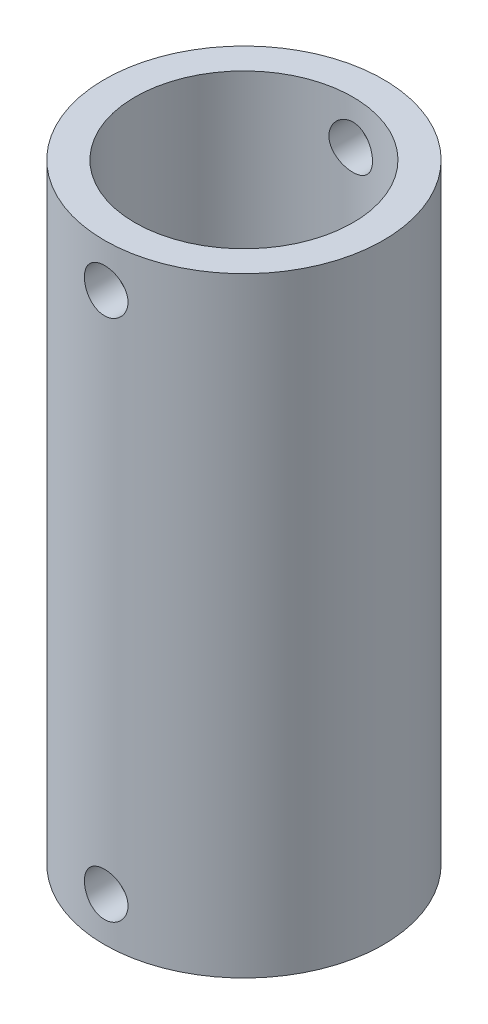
ISO-10303-21;
HEADER;
FILE_DESCRIPTION(('STEP AP214'),'2;1');
FILE_NAME('part.step','',(''),(''),'','','');
FILE_SCHEMA(('AUTOMOTIVE_DESIGN { 1 0 10303 214 1 1 1 1 }'));
ENDSEC;
DATA;
#1=APPLICATION_CONTEXT('core data for automotive mechanical design processes');
#2=APPLICATION_PROTOCOL_DEFINITION('international standard','automotive_design',2000,#1);
#3=PRODUCT_CONTEXT('',#1,'mechanical');
#4=PRODUCT('Part','Part','',(#3));
#5=PRODUCT_RELATED_PRODUCT_CATEGORY('part','',(#4));
#6=PRODUCT_DEFINITION_FORMATION('','',#4);
#7=PRODUCT_DEFINITION_CONTEXT('part definition',#1,'design');
#8=PRODUCT_DEFINITION('design','',#6,#7);
#9=PRODUCT_DEFINITION_SHAPE('','',#8);
#10=(LENGTH_UNIT() NAMED_UNIT(*) SI_UNIT(.MILLI.,.METRE.));
#11=(NAMED_UNIT(*) PLANE_ANGLE_UNIT() SI_UNIT($,.RADIAN.));
#12=(NAMED_UNIT(*) SI_UNIT($,.STERADIAN.) SOLID_ANGLE_UNIT());
#13=UNCERTAINTY_MEASURE_WITH_UNIT(LENGTH_MEASURE(1.E-05),#10,'distance_accuracy_value','');
#14=(GEOMETRIC_REPRESENTATION_CONTEXT(3) GLOBAL_UNCERTAINTY_ASSIGNED_CONTEXT((#13)) GLOBAL_UNIT_ASSIGNED_CONTEXT((#10,
#11,#12)) REPRESENTATION_CONTEXT('',''));
#15=CARTESIAN_POINT('',(0.,0.,0.));
#16=DIRECTION('',(0.,0.,1.));
#17=DIRECTION('',(1.,0.,0.));
#18=AXIS2_PLACEMENT_3D('',#15,#16,#17);
#19=CARTESIAN_POINT('',(0.,69.99,0.));
#20=DIRECTION('',(0.,1.,0.));
#21=DIRECTION('',(0.,0.,1.));
#22=AXIS2_PLACEMENT_3D('',#19,#20,#21);
#23=PLANE('',#22);
#24=CARTESIAN_POINT('',(0.,69.99,0.));
#25=DIRECTION('',(0.,1.,0.));
#26=DIRECTION('',(0.,0.,1.));
#27=AXIS2_PLACEMENT_3D('',#24,#25,#26);
#28=CIRCLE('',#27,16.);
#29=CARTESIAN_POINT('',(0.,69.99,16.));
#30=VERTEX_POINT('',#29);
#31=EDGE_CURVE('E10',#30,#30,#28,.T.);
#32=ORIENTED_EDGE('',*,*,#31,.T.);
#33=EDGE_LOOP('',(#32));
#34=FACE_BOUND('',#33,.T.);
#35=CARTESIAN_POINT('',(0.,69.99,0.));
#36=DIRECTION('',(0.,1.,0.));
#37=DIRECTION('',(0.,0.,1.));
#38=AXIS2_PLACEMENT_3D('',#35,#36,#37);
#39=CIRCLE('',#38,12.5);
#40=CARTESIAN_POINT('',(0.,69.99,12.5));
#41=VERTEX_POINT('',#40);
#42=EDGE_CURVE('E46',#41,#41,#39,.T.);
#43=ORIENTED_EDGE('',*,*,#42,.F.);
#44=EDGE_LOOP('',(#43));
#45=FACE_BOUND('',#44,.T.);
#46=ADVANCED_FACE('F28',(#34,#45),#23,.T.);
#47=CARTESIAN_POINT('',(0.,0.,0.));
#48=DIRECTION('',(0.,1.,0.));
#49=DIRECTION('',(0.,0.,1.));
#50=AXIS2_PLACEMENT_3D('',#47,#48,#49);
#51=PLANE('',#50);
#52=CARTESIAN_POINT('',(0.,0.,0.));
#53=DIRECTION('',(0.,1.,0.));
#54=DIRECTION('',(0.,0.,1.));
#55=AXIS2_PLACEMENT_3D('',#52,#53,#54);
#56=CIRCLE('',#55,16.);
#57=CARTESIAN_POINT('',(0.,0.,16.));
#58=VERTEX_POINT('',#57);
#59=EDGE_CURVE('E41',#58,#58,#56,.T.);
#60=ORIENTED_EDGE('',*,*,#59,.F.);
#61=EDGE_LOOP('',(#60));
#62=FACE_BOUND('',#61,.T.);
#63=CARTESIAN_POINT('',(0.,0.,0.));
#64=DIRECTION('',(0.,1.,0.));
#65=DIRECTION('',(0.,0.,1.));
#66=AXIS2_PLACEMENT_3D('',#63,#64,#65);
#67=CIRCLE('',#66,12.5);
#68=CARTESIAN_POINT('',(0.,0.,12.5));
#69=VERTEX_POINT('',#68);
#70=EDGE_CURVE('E89',#69,#69,#67,.T.);
#71=ORIENTED_EDGE('',*,*,#70,.T.);
#72=EDGE_LOOP('',(#71));
#73=FACE_BOUND('',#72,.T.);
#74=ADVANCED_FACE('F97',(#62,#73),#51,.F.);
#75=CARTESIAN_POINT('',(0.,69.99,0.));
#76=DIRECTION('',(0.,-1.,0.));
#77=DIRECTION('',(0.,0.,-1.));
#78=AXIS2_PLACEMENT_3D('',#75,#76,#77);
#79=CYLINDRICAL_SURFACE('',#78,16.);
#80=CARTESIAN_POINT('',(0.,7.50000000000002,-16.));
#81=CARTESIAN_POINT('',(-0.139515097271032,7.49999430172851,-15.9999977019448));
#82=CARTESIAN_POINT('',(-0.279109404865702,7.48828188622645,-15.9981561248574));
#83=CARTESIAN_POINT('',(-0.5543913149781,7.44175630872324,-15.9909869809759));
#84=CARTESIAN_POINT('',(-0.690075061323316,7.40692110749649,-15.9856560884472));
#85=CARTESIAN_POINT('',(-0.953512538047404,7.31522033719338,-15.9721069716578));
#86=CARTESIAN_POINT('',(-1.0812723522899,7.2583719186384,-15.9638909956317));
#87=CARTESIAN_POINT('',(-1.3254212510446,7.12430145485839,-15.9454779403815));
#88=CARTESIAN_POINT('',(-1.44181181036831,7.04708205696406,-15.9352811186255));
#89=CARTESIAN_POINT('',(-1.66091991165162,6.87376695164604,-15.9139426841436));
#90=CARTESIAN_POINT('',(-1.76352747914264,6.77753300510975,-15.9027945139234));
#91=CARTESIAN_POINT('',(-1.95120768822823,6.56921805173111,-15.8808607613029));
#92=CARTESIAN_POINT('',(-2.03627928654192,6.4571361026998,-15.8700752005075));
#93=CARTESIAN_POINT('',(-2.18690544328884,6.21956172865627,-15.8500242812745));
#94=CARTESIAN_POINT('',(-2.25235273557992,6.09400051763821,-15.840767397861));
#95=CARTESIAN_POINT('',(-2.36118681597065,5.83349858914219,-15.8249120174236));
#96=CARTESIAN_POINT('',(-2.40457491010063,5.69855842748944,-15.8183133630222));
#97=CARTESIAN_POINT('',(-2.46771559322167,5.42428909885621,-15.8085863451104));
#98=CARTESIAN_POINT('',(-2.48765705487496,5.2850044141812,-15.8054302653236));
#99=CARTESIAN_POINT('',(-2.50392369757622,5.00503281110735,-15.8028617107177));
#100=CARTESIAN_POINT('',(-2.50025034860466,4.86434598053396,-15.8034490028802));
#101=CARTESIAN_POINT('',(-2.4695458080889,4.58690296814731,-15.8082755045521));
#102=CARTESIAN_POINT('',(-2.44272562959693,4.45012277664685,-15.8124817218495));
#103=CARTESIAN_POINT('',(-2.36681937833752,4.18302799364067,-15.8240205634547));
#104=CARTESIAN_POINT('',(-2.31773262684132,4.05271359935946,-15.8313532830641));
#105=CARTESIAN_POINT('',(-2.19846916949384,3.80161128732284,-15.8483550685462));
#106=CARTESIAN_POINT('',(-2.12820372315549,3.68086620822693,-15.8580339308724));
#107=CARTESIAN_POINT('',(-1.96864058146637,3.45280046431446,-15.878630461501));
#108=CARTESIAN_POINT('',(-1.87934153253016,3.34548075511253,-15.8895482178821));
#109=CARTESIAN_POINT('',(-1.68309088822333,3.14608975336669,-15.911537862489));
#110=CARTESIAN_POINT('',(-1.57595800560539,3.05419684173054,-15.9226101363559));
#111=CARTESIAN_POINT('',(-1.34769694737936,2.8896668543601,-15.9435512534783));
#112=CARTESIAN_POINT('',(-1.22656870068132,2.81702987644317,-15.9534200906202));
#113=CARTESIAN_POINT('',(-0.973595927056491,2.69306192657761,-15.9708539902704));
#114=CARTESIAN_POINT('',(-0.84174418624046,2.641745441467,-15.9784174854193));
#115=CARTESIAN_POINT('',(-0.571149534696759,2.56203403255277,-15.9903756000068));
#116=CARTESIAN_POINT('',(-0.432407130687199,2.53363742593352,-15.9947704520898));
#117=CARTESIAN_POINT('',(-0.153508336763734,2.50081072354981,-15.9998651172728));
#118=CARTESIAN_POINT('',(-0.0133814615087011,2.49613552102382,-16.0006027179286));
#119=CARTESIAN_POINT('',(0.265654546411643,2.51023270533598,-15.9984028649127));
#120=CARTESIAN_POINT('',(0.404563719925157,2.52900430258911,-15.9954655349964));
#121=CARTESIAN_POINT('',(0.676473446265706,2.58925838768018,-15.9862692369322));
#122=CARTESIAN_POINT('',(0.809501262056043,2.63062075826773,-15.9800278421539));
#123=CARTESIAN_POINT('',(1.06673406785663,2.73475509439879,-15.9649207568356));
#124=CARTESIAN_POINT('',(1.19093861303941,2.79752813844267,-15.9560549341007));
#125=CARTESIAN_POINT('',(1.42807220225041,2.94327199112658,-15.9365897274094));
#126=CARTESIAN_POINT('',(1.54090512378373,3.02639742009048,-15.9259772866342));
#127=CARTESIAN_POINT('',(1.75110696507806,3.21027208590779,-15.9042388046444));
#128=CARTESIAN_POINT('',(1.84847490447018,3.31102243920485,-15.8931127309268));
#129=CARTESIAN_POINT('',(2.02588080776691,3.52838119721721,-15.8714802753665));
#130=CARTESIAN_POINT('',(2.10575398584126,3.64512484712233,-15.860980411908));
#131=CARTESIAN_POINT('',(2.2447556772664,3.89051607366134,-15.8419069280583));
#132=CARTESIAN_POINT('',(2.30388478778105,4.01916330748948,-15.83333325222));
#133=CARTESIAN_POINT('',(2.39946771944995,4.28422964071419,-15.8191307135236));
#134=CARTESIAN_POINT('',(2.43600654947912,4.42061746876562,-15.8134908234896));
#135=CARTESIAN_POINT('',(2.48564122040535,4.69768914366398,-15.8057657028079));
#136=CARTESIAN_POINT('',(2.49873883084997,4.83837266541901,-15.8036802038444));
#137=CARTESIAN_POINT('',(2.50107452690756,5.11839871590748,-15.8033105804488));
#138=CARTESIAN_POINT('',(2.49057180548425,5.2577390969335,-15.804985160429));
#139=CARTESIAN_POINT('',(2.44656223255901,5.53264529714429,-15.8118569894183));
#140=CARTESIAN_POINT('',(2.41305543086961,5.66821112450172,-15.8170542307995));
#141=CARTESIAN_POINT('',(2.32408329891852,5.93163782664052,-15.8303708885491));
#142=CARTESIAN_POINT('',(2.26863761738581,6.05950547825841,-15.8384876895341));
#143=CARTESIAN_POINT('',(2.13738768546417,6.30416561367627,-15.856731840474));
#144=CARTESIAN_POINT('',(2.06158262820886,6.42095765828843,-15.8668592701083));
#145=CARTESIAN_POINT('',(1.8908300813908,6.64146554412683,-15.8881156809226));
#146=CARTESIAN_POINT('',(1.79569107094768,6.74503219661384,-15.8992540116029));
#147=CARTESIAN_POINT('',(1.58937594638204,6.93482123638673,-15.9212004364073));
#148=CARTESIAN_POINT('',(1.47819612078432,7.02103959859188,-15.9320084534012));
#149=CARTESIAN_POINT('',(1.24216685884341,7.17415122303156,-15.952151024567));
#150=CARTESIAN_POINT('',(1.11723937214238,7.24092537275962,-15.9614763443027));
#151=CARTESIAN_POINT('',(0.857851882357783,7.35244099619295,-15.9775125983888));
#152=CARTESIAN_POINT('',(0.723401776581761,7.39720497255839,-15.9842262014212));
#153=CARTESIAN_POINT('',(0.490314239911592,7.45343302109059,-15.9927744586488));
#154=CARTESIAN_POINT('',(0.393105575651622,7.470868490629,-15.9954699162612));
#155=CARTESIAN_POINT('',(0.19727779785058,7.49415391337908,-15.9990834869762));
#156=CARTESIAN_POINT('',(0.0986587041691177,7.50000402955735,-16.0000016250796));
#157=CARTESIAN_POINT('',(0.,7.50000000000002,-16.));
#158=B_SPLINE_CURVE_WITH_KNOTS('',3,(#80,#81,#82,#83,#84,#85,#86,#87,#88,#89,#90,#91,#92,#93,
#94,#95,#96,#97,#98,#99,#100,#101,#102,#103,#104,#105,#106,#107,#108,#109,#110,#111,#112,#113,
#114,#115,#116,#117,#118,#119,#120,#121,#122,#123,#124,#125,#126,#127,#128,#129,#130,#131,#132,
#133,#134,#135,#136,#137,#138,#139,#140,#141,#142,#143,#144,#145,#146,#147,#148,#149,#150,#151,
#152,#153,#154,#155,#156,#157),.UNSPECIFIED.,.T.,.F.,(4,2,2,2,2,2,2,2,2,2,2,2,2,2,2,2,2,2,2,2,2,
2,2,2,2,2,2,2,2,2,2,2,2,2,2,2,2,2,4),(0.,0.41818474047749,0.836768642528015,1.25502707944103,
1.6732311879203,2.09459568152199,2.51598523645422,2.93963778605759,3.36326525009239,
3.78345631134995,4.20362121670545,4.6199957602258,5.03638299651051,5.45453977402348,
5.87272629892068,6.29545732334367,6.71819049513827,7.14121043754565,7.56419931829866,
7.98280854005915,8.40140366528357,8.81779444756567,9.23420620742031,9.65388541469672,
10.0735912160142,10.4970948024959,10.9205861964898,11.3424741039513,11.764330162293,
12.1815758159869,12.598820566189,13.0156924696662,13.4325808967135,13.8538201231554,
14.275156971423,14.6990230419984,15.1224548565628,15.4181801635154,15.7139013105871),.UNSPECIFIED.);
#159=CARTESIAN_POINT('',(0.,7.50000000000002,-16.));
#160=VERTEX_POINT('',#159);
#161=EDGE_CURVE('E57',#160,#160,#158,.T.);
#162=ORIENTED_EDGE('',*,*,#161,.T.);
#163=EDGE_LOOP('',(#162));
#164=FACE_BOUND('',#163,.T.);
#165=CARTESIAN_POINT('',(2.5,5.,15.8034806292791));
#166=CARTESIAN_POINT('',(2.49999429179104,4.86049662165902,15.8034830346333));
#167=CARTESIAN_POINT('',(2.48828377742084,4.72091400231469,15.8053478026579));
#168=CARTESIAN_POINT('',(2.44176643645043,4.44565637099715,15.8125997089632));
#169=CARTESIAN_POINT('',(2.40693752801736,4.30998522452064,15.8179902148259));
#170=CARTESIAN_POINT('',(2.31525516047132,4.04657441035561,15.8316684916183));
#171=CARTESIAN_POINT('',(2.25841914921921,3.91882855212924,15.8399539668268));
#172=CARTESIAN_POINT('',(2.12437791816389,3.67470310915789,15.8584858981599));
#173=CARTESIAN_POINT('',(2.04717531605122,3.55832206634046,15.8687321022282));
#174=CARTESIAN_POINT('',(1.8738773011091,3.33920351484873,15.8901303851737));
#175=CARTESIAN_POINT('',(1.77763988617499,3.23657892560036,15.9012888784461));
#176=CARTESIAN_POINT('',(1.56931080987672,3.04886577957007,15.9231973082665));
#177=CARTESIAN_POINT('',(1.45721825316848,2.96377821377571,15.9339472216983));
#178=CARTESIAN_POINT('',(1.21963429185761,2.81313512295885,15.9538946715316));
#179=CARTESIAN_POINT('',(1.09407592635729,2.74768399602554,15.9630838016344));
#180=CARTESIAN_POINT('',(0.833580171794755,2.63884204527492,15.978803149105));
#181=CARTESIAN_POINT('',(0.698643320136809,2.59544995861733,15.9853335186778));
#182=CARTESIAN_POINT('',(0.42438532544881,2.53230128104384,15.9949542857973));
#183=CARTESIAN_POINT('',(0.28510876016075,2.51235535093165,15.9980722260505));
#184=CARTESIAN_POINT('',(0.00515314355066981,2.49607695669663,16.0006113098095));
#185=CARTESIAN_POINT('',(-0.135525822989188,2.49974307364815,16.0000326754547));
#186=CARTESIAN_POINT('',(-0.413000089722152,2.53043592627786,15.9952657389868));
#187=CARTESIAN_POINT('',(-0.549818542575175,2.55725893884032,15.9911089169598));
#188=CARTESIAN_POINT('',(-0.816988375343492,2.63318402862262,15.9796877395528));
#189=CARTESIAN_POINT('',(-0.947339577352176,2.68228671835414,15.9724232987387));
#190=CARTESIAN_POINT('',(-1.19848742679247,2.80158365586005,15.9555491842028));
#191=CARTESIAN_POINT('',(-1.31924299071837,2.87186300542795,15.9459300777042));
#192=CARTESIAN_POINT('',(-1.54732385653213,3.03145608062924,15.9254174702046));
#193=CARTESIAN_POINT('',(-1.65464819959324,3.12077116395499,15.9145238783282));
#194=CARTESIAN_POINT('',(-1.85402198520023,3.31703348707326,15.8925387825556));
#195=CARTESIAN_POINT('',(-1.94589625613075,3.42415866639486,15.8814464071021));
#196=CARTESIAN_POINT('',(-2.11039226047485,3.65239756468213,15.8604269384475));
#197=CARTESIAN_POINT('',(-2.18301385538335,3.77351138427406,15.8504998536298));
#198=CARTESIAN_POINT('',(-2.30697060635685,4.0264796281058,15.8329349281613));
#199=CARTESIAN_POINT('',(-2.35828663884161,4.15834357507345,15.8252991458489));
#200=CARTESIAN_POINT('',(-2.43799343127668,4.42896484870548,15.8132168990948));
#201=CARTESIAN_POINT('',(-2.46638595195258,4.56772164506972,15.8087701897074));
#202=CARTESIAN_POINT('',(-2.49919719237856,4.84662810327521,15.8036163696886));
#203=CARTESIAN_POINT('',(-2.50386473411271,4.98674780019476,15.80287044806));
#204=CARTESIAN_POINT('',(-2.48975479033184,5.26576763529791,15.8050994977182));
#205=CARTESIAN_POINT('',(-2.47097809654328,5.40466781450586,15.8080743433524));
#206=CARTESIAN_POINT('',(-2.41072412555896,5.67652780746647,15.8173740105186));
#207=CARTESIAN_POINT('',(-2.36937178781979,5.8095159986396,15.8236803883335));
#208=CARTESIAN_POINT('',(-2.26527072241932,6.06667397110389,15.8389172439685));
#209=CARTESIAN_POINT('',(-2.20252085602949,6.19084328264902,15.8478478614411));
#210=CARTESIAN_POINT('',(-2.05681199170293,6.42795128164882,15.8674179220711));
#211=CARTESIAN_POINT('',(-1.97369251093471,6.54079022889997,15.8780706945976));
#212=CARTESIAN_POINT('',(-1.78982593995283,6.75100698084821,15.8998450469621));
#213=CARTESIAN_POINT('',(-1.6890777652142,6.84838383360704,15.9109666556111));
#214=CARTESIAN_POINT('',(-1.47171546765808,7.02581127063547,15.9325473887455));
#215=CARTESIAN_POINT('',(-1.35496564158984,7.10569657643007,15.9429995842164));
#216=CARTESIAN_POINT('',(-1.10955861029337,7.24471951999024,15.9619548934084));
#217=CARTESIAN_POINT('',(-0.980901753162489,7.30385776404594,15.9704580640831));
#218=CARTESIAN_POINT('',(-0.715839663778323,7.39944627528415,15.9845269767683));
#219=CARTESIAN_POINT('',(-0.579467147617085,7.43598549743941,15.9901042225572));
#220=CARTESIAN_POINT('',(-0.302427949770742,7.48562613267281,15.9977412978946));
#221=CARTESIAN_POINT('',(-0.161761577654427,7.49872923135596,15.9998013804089));
#222=CARTESIAN_POINT('',(0.118272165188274,7.50108185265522,16.0001691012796));
#223=CARTESIAN_POINT('',(0.25763742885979,7.49058374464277,15.9985164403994));
#224=CARTESIAN_POINT('',(0.532594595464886,7.44657468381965,15.9917247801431));
#225=CARTESIAN_POINT('',(0.668186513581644,7.41306382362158,15.9865857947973));
#226=CARTESIAN_POINT('',(0.931668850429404,7.32407274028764,15.9733964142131));
#227=CARTESIAN_POINT('',(1.05956579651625,7.26861144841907,15.965348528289));
#228=CARTESIAN_POINT('',(1.30427807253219,7.13732116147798,15.947223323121));
#229=CARTESIAN_POINT('',(1.42109298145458,7.06149139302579,15.9371459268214));
#230=CARTESIAN_POINT('',(1.64160219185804,6.89071055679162,15.9159528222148));
#231=CARTESIAN_POINT('',(1.745151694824,6.79557368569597,15.9048276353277));
#232=CARTESIAN_POINT('',(1.93490712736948,6.5892700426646,15.8828612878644));
#233=CARTESIAN_POINT('',(2.02110898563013,6.4780995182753,15.8720201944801));
#234=CARTESIAN_POINT('',(2.17420151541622,6.24207889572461,15.8517779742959));
#235=CARTESIAN_POINT('',(2.24097044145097,6.11714904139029,15.842386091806));
#236=CARTESIAN_POINT('',(2.35247565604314,5.85775678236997,15.8262143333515));
#237=CARTESIAN_POINT('',(2.3972345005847,5.72330429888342,15.8194317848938));
#238=CARTESIAN_POINT('',(2.45344906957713,5.4902302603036,15.8107909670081));
#239=CARTESIAN_POINT('',(2.47087849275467,5.39303840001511,15.8080643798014));
#240=CARTESIAN_POINT('',(2.49415589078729,5.19724421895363,15.804408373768));
#241=CARTESIAN_POINT('',(2.50000403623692,5.09864191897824,15.8034789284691));
#242=CARTESIAN_POINT('',(2.5,5.,15.8034806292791));
#243=B_SPLINE_CURVE_WITH_KNOTS('',3,(#165,#166,#167,#168,#169,#170,#171,#172,#173,#174,#175,
#176,#177,#178,#179,#180,#181,#182,#183,#184,#185,#186,#187,#188,#189,#190,#191,#192,#193,#194,
#195,#196,#197,#198,#199,#200,#201,#202,#203,#204,#205,#206,#207,#208,#209,#210,#211,#212,#213,
#214,#215,#216,#217,#218,#219,#220,#221,#222,#223,#224,#225,#226,#227,#228,#229,#230,#231,#232,
#233,#234,#235,#236,#237,#238,#239,#240,#241,#242),.UNSPECIFIED.,.T.,.F.,(4,2,2,2,2,2,2,2,2,2,2,
2,2,2,2,2,2,2,2,2,2,2,2,2,2,2,2,2,2,2,2,2,2,2,2,2,2,2,4),(0.,0.41814952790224,0.836699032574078,
1.25491737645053,1.67308199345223,2.09449258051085,2.51592697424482,2.93956378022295,
3.36317633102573,3.78334397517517,4.20348637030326,4.61996979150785,5.03646466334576,
5.45465612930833,5.87287743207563,6.29556043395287,6.71824647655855,7.1413111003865,
7.56434322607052,7.98292940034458,8.40150143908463,8.81778013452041,9.23408098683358,
9.65377352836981,10.0734918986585,10.4970197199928,10.9205351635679,11.3423727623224,
11.7641800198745,12.18149834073,12.5988149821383,13.0157724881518,13.432745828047,
13.8539404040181,14.275233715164,14.6991122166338,15.1225554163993,15.4182305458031,
15.7139013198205),.UNSPECIFIED.);
#244=CARTESIAN_POINT('',(2.5,5.,15.8034806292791));
#245=VERTEX_POINT('',#244);
#246=EDGE_CURVE('E135',#245,#245,#243,.T.);
#247=ORIENTED_EDGE('',*,*,#246,.T.);
#248=EDGE_LOOP('',(#247));
#249=FACE_BOUND('',#248,.T.);
#250=CARTESIAN_POINT('',(0.,67.5,-16.));
#251=CARTESIAN_POINT('',(-0.139515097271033,67.4999943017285,-15.9999977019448));
#252=CARTESIAN_POINT('',(-0.279109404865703,67.4882818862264,-15.9981561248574));
#253=CARTESIAN_POINT('',(-0.554391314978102,67.4417563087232,-15.9909869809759));
#254=CARTESIAN_POINT('',(-0.690075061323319,67.4069211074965,-15.9856560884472));
#255=CARTESIAN_POINT('',(-0.953512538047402,67.3152203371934,-15.9721069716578));
#256=CARTESIAN_POINT('',(-1.0812723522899,67.2583719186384,-15.9638909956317));
#257=CARTESIAN_POINT('',(-1.32542125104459,67.1243014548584,-15.9454779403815));
#258=CARTESIAN_POINT('',(-1.44181181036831,67.0470820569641,-15.9352811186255));
#259=CARTESIAN_POINT('',(-1.66091991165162,66.8737669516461,-15.9139426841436));
#260=CARTESIAN_POINT('',(-1.76352747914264,66.7775330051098,-15.9027945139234));
#261=CARTESIAN_POINT('',(-1.95120768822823,66.5692180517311,-15.8808607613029));
#262=CARTESIAN_POINT('',(-2.03627928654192,66.4571361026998,-15.8700752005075));
#263=CARTESIAN_POINT('',(-2.18690544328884,66.2195617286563,-15.8500242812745));
#264=CARTESIAN_POINT('',(-2.25235273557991,66.0940005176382,-15.840767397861));
#265=CARTESIAN_POINT('',(-2.36118681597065,65.8334985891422,-15.8249120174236));
#266=CARTESIAN_POINT('',(-2.40457491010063,65.6985584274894,-15.8183133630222));
#267=CARTESIAN_POINT('',(-2.46771559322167,65.4242890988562,-15.8085863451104));
#268=CARTESIAN_POINT('',(-2.48765705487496,65.2850044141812,-15.8054302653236));
#269=CARTESIAN_POINT('',(-2.50392369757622,65.0050328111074,-15.8028617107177));
#270=CARTESIAN_POINT('',(-2.50025034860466,64.864345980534,-15.8034490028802));
#271=CARTESIAN_POINT('',(-2.4695458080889,64.5869029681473,-15.8082755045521));
#272=CARTESIAN_POINT('',(-2.44272562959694,64.4501227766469,-15.8124817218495));
#273=CARTESIAN_POINT('',(-2.36681937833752,64.1830279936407,-15.8240205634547));
#274=CARTESIAN_POINT('',(-2.31773262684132,64.0527135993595,-15.8313532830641));
#275=CARTESIAN_POINT('',(-2.19846916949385,63.8016112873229,-15.8483550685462));
#276=CARTESIAN_POINT('',(-2.1282037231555,63.6808662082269,-15.8580339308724));
#277=CARTESIAN_POINT('',(-1.96864058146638,63.4528004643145,-15.878630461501));
#278=CARTESIAN_POINT('',(-1.87934153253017,63.3454807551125,-15.8895482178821));
#279=CARTESIAN_POINT('',(-1.68309088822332,63.1460897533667,-15.911537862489));
#280=CARTESIAN_POINT('',(-1.57595800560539,63.0541968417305,-15.9226101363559));
#281=CARTESIAN_POINT('',(-1.34769694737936,62.8896668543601,-15.9435512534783));
#282=CARTESIAN_POINT('',(-1.22656870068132,62.8170298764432,-15.9534200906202));
#283=CARTESIAN_POINT('',(-0.97359592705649,62.6930619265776,-15.9708539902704));
#284=CARTESIAN_POINT('',(-0.841744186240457,62.641745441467,-15.9784174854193));
#285=CARTESIAN_POINT('',(-0.571149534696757,62.5620340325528,-15.9903756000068));
#286=CARTESIAN_POINT('',(-0.4324071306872,62.5336374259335,-15.9947704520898));
#287=CARTESIAN_POINT('',(-0.153508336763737,62.5008107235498,-15.9998651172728));
#288=CARTESIAN_POINT('',(-0.0133814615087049,62.4961355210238,-16.0006027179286));
#289=CARTESIAN_POINT('',(0.265654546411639,62.510232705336,-15.9984028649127));
#290=CARTESIAN_POINT('',(0.404563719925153,62.5290043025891,-15.9954655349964));
#291=CARTESIAN_POINT('',(0.676473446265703,62.5892583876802,-15.9862692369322));
#292=CARTESIAN_POINT('',(0.809501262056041,62.6306207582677,-15.9800278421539));
#293=CARTESIAN_POINT('',(1.06673406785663,62.7347550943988,-15.9649207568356));
#294=CARTESIAN_POINT('',(1.19093861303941,62.7975281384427,-15.9560549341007));
#295=CARTESIAN_POINT('',(1.42807220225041,62.9432719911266,-15.9365897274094));
#296=CARTESIAN_POINT('',(1.54090512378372,63.0263974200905,-15.9259772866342));
#297=CARTESIAN_POINT('',(1.75110696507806,63.2102720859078,-15.9042388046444));
#298=CARTESIAN_POINT('',(1.84847490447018,63.3110224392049,-15.8931127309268));
#299=CARTESIAN_POINT('',(2.0258808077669,63.5283811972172,-15.8714802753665));
#300=CARTESIAN_POINT('',(2.10575398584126,63.6451248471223,-15.860980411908));
#301=CARTESIAN_POINT('',(2.2447556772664,63.8905160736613,-15.8419069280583));
#302=CARTESIAN_POINT('',(2.30388478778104,64.0191633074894,-15.83333325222));
#303=CARTESIAN_POINT('',(2.39946771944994,64.2842296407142,-15.8191307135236));
#304=CARTESIAN_POINT('',(2.43600654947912,64.4206174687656,-15.8134908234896));
#305=CARTESIAN_POINT('',(2.48564122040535,64.697689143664,-15.8057657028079));
#306=CARTESIAN_POINT('',(2.49873883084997,64.838372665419,-15.8036802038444));
#307=CARTESIAN_POINT('',(2.50107452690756,65.1183987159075,-15.8033105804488));
#308=CARTESIAN_POINT('',(2.49057180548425,65.2577390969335,-15.804985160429));
#309=CARTESIAN_POINT('',(2.44656223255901,65.5326452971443,-15.8118569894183));
#310=CARTESIAN_POINT('',(2.41305543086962,65.6682111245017,-15.8170542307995));
#311=CARTESIAN_POINT('',(2.32408329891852,65.9316378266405,-15.830370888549));
#312=CARTESIAN_POINT('',(2.26863761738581,66.0595054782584,-15.8384876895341));
#313=CARTESIAN_POINT('',(2.13738768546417,66.3041656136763,-15.856731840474));
#314=CARTESIAN_POINT('',(2.06158262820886,66.4209576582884,-15.8668592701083));
#315=CARTESIAN_POINT('',(1.8908300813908,66.6414655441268,-15.8881156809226));
#316=CARTESIAN_POINT('',(1.79569107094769,66.7450321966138,-15.8992540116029));
#317=CARTESIAN_POINT('',(1.58937594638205,66.9348212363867,-15.9212004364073));
#318=CARTESIAN_POINT('',(1.47819612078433,67.0210395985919,-15.9320084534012));
#319=CARTESIAN_POINT('',(1.24216685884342,67.1741512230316,-15.952151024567));
#320=CARTESIAN_POINT('',(1.11723937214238,67.2409253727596,-15.9614763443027));
#321=CARTESIAN_POINT('',(0.857851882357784,67.352440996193,-15.9775125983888));
#322=CARTESIAN_POINT('',(0.723401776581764,67.3972049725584,-15.9842262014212));
#323=CARTESIAN_POINT('',(0.490314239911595,67.4534330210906,-15.9927744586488));
#324=CARTESIAN_POINT('',(0.393105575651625,67.470868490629,-15.9954699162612));
#325=CARTESIAN_POINT('',(0.197277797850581,67.4941539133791,-15.9990834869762));
#326=CARTESIAN_POINT('',(0.0986587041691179,67.5000040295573,-16.0000016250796));
#327=CARTESIAN_POINT('',(0.,67.5,-16.));
#328=B_SPLINE_CURVE_WITH_KNOTS('',3,(#250,#251,#252,#253,#254,#255,#256,#257,#258,#259,#260,
#261,#262,#263,#264,#265,#266,#267,#268,#269,#270,#271,#272,#273,#274,#275,#276,#277,#278,#279,
#280,#281,#282,#283,#284,#285,#286,#287,#288,#289,#290,#291,#292,#293,#294,#295,#296,#297,#298,
#299,#300,#301,#302,#303,#304,#305,#306,#307,#308,#309,#310,#311,#312,#313,#314,#315,#316,#317,
#318,#319,#320,#321,#322,#323,#324,#325,#326,#327),.UNSPECIFIED.,.T.,.F.,(4,2,2,2,2,2,2,2,2,2,2,
2,2,2,2,2,2,2,2,2,2,2,2,2,2,2,2,2,2,2,2,2,2,2,2,2,2,2,4),(0.,0.418184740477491,
0.836768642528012,1.25502707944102,1.6732311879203,2.09459568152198,2.51598523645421,
2.93963778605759,3.36326525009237,3.78345631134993,4.20362121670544,4.61999576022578,
5.0363829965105,5.45453977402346,5.87272629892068,6.29545732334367,6.71819049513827,
7.14121043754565,7.56419931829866,7.98280854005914,8.40140366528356,8.81779444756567,
9.23420620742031,9.65388541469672,10.0735912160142,10.4970948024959,10.9205861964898,
11.3424741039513,11.764330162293,12.1815758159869,12.598820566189,13.0156924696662,
13.4325808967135,13.8538201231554,14.275156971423,14.6990230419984,15.1224548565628,
15.4181801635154,15.7139013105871),.UNSPECIFIED.);
#329=CARTESIAN_POINT('',(0.,67.5,-16.));
#330=VERTEX_POINT('',#329);
#331=EDGE_CURVE('E81',#330,#330,#328,.T.);
#332=ORIENTED_EDGE('',*,*,#331,.T.);
#333=EDGE_LOOP('',(#332));
#334=FACE_BOUND('',#333,.T.);
#335=CARTESIAN_POINT('',(2.5,65.,15.8034806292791));
#336=CARTESIAN_POINT('',(2.49999429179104,64.860496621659,15.8034830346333));
#337=CARTESIAN_POINT('',(2.48828377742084,64.7209140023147,15.8053478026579));
#338=CARTESIAN_POINT('',(2.44176643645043,64.4456563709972,15.8125997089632));
#339=CARTESIAN_POINT('',(2.40693752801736,64.3099852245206,15.8179902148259));
#340=CARTESIAN_POINT('',(2.31525516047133,64.0465744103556,15.8316684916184));
#341=CARTESIAN_POINT('',(2.25841914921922,63.9188285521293,15.8399539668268));
#342=CARTESIAN_POINT('',(2.12437791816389,63.6747031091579,15.8584858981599));
#343=CARTESIAN_POINT('',(2.04717531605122,63.5583220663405,15.8687321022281));
#344=CARTESIAN_POINT('',(1.87387730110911,63.3392035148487,15.8901303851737));
#345=CARTESIAN_POINT('',(1.77763988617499,63.2365789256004,15.9012888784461));
#346=CARTESIAN_POINT('',(1.56931080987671,63.0488657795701,15.9231973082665));
#347=CARTESIAN_POINT('',(1.45721825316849,62.9637782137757,15.9339472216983));
#348=CARTESIAN_POINT('',(1.21963429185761,62.8131351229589,15.9538946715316));
#349=CARTESIAN_POINT('',(1.09407592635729,62.7476839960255,15.9630838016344));
#350=CARTESIAN_POINT('',(0.833580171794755,62.6388420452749,15.978803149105));
#351=CARTESIAN_POINT('',(0.698643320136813,62.5954499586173,15.9853335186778));
#352=CARTESIAN_POINT('',(0.424385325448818,62.5323012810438,15.9949542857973));
#353=CARTESIAN_POINT('',(0.285108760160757,62.5123553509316,15.9980722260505));
#354=CARTESIAN_POINT('',(0.00515314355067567,62.4960769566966,16.0006113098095));
#355=CARTESIAN_POINT('',(-0.135525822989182,62.4997430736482,16.0000326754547));
#356=CARTESIAN_POINT('',(-0.413000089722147,62.5304359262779,15.9952657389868));
#357=CARTESIAN_POINT('',(-0.54981854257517,62.5572589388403,15.9911089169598));
#358=CARTESIAN_POINT('',(-0.816988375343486,62.6331840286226,15.9796877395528));
#359=CARTESIAN_POINT('',(-0.947339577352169,62.6822867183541,15.9724232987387));
#360=CARTESIAN_POINT('',(-1.19848742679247,62.8015836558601,15.9555491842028));
#361=CARTESIAN_POINT('',(-1.31924299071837,62.8718630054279,15.9459300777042));
#362=CARTESIAN_POINT('',(-1.54732385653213,63.0314560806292,15.9254174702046));
#363=CARTESIAN_POINT('',(-1.65464819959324,63.120771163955,15.9145238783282));
#364=CARTESIAN_POINT('',(-1.85402198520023,63.3170334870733,15.8925387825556));
#365=CARTESIAN_POINT('',(-1.94589625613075,63.4241586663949,15.8814464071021));
#366=CARTESIAN_POINT('',(-2.11039226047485,63.6523975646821,15.8604269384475));
#367=CARTESIAN_POINT('',(-2.18301385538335,63.7735113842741,15.8504998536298));
#368=CARTESIAN_POINT('',(-2.30697060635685,64.0264796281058,15.8329349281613));
#369=CARTESIAN_POINT('',(-2.35828663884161,64.1583435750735,15.8252991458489));
#370=CARTESIAN_POINT('',(-2.43799343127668,64.4289648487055,15.8132168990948));
#371=CARTESIAN_POINT('',(-2.46638595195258,64.5677216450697,15.8087701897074));
#372=CARTESIAN_POINT('',(-2.49919719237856,64.8466281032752,15.8036163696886));
#373=CARTESIAN_POINT('',(-2.50386473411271,64.9867478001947,15.80287044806));
#374=CARTESIAN_POINT('',(-2.48975479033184,65.2657676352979,15.8050994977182));
#375=CARTESIAN_POINT('',(-2.47097809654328,65.4046678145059,15.8080743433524));
#376=CARTESIAN_POINT('',(-2.41072412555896,65.6765278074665,15.8173740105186));
#377=CARTESIAN_POINT('',(-2.36937178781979,65.8095159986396,15.8236803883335));
#378=CARTESIAN_POINT('',(-2.26527072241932,66.0666739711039,15.8389172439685));
#379=CARTESIAN_POINT('',(-2.20252085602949,66.190843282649,15.8478478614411));
#380=CARTESIAN_POINT('',(-2.05681199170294,66.4279512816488,15.8674179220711));
#381=CARTESIAN_POINT('',(-1.97369251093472,66.5407902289,15.8780706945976));
#382=CARTESIAN_POINT('',(-1.78982593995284,66.7510069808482,15.8998450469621));
#383=CARTESIAN_POINT('',(-1.68907776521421,66.848383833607,15.9109666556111));
#384=CARTESIAN_POINT('',(-1.47171546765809,67.0258112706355,15.9325473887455));
#385=CARTESIAN_POINT('',(-1.35496564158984,67.1056965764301,15.9429995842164));
#386=CARTESIAN_POINT('',(-1.10955861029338,67.2447195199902,15.9619548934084));
#387=CARTESIAN_POINT('',(-0.980901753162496,67.3038577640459,15.9704580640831));
#388=CARTESIAN_POINT('',(-0.715839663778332,67.3994462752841,15.9845269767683));
#389=CARTESIAN_POINT('',(-0.579467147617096,67.4359854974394,15.9901042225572));
#390=CARTESIAN_POINT('',(-0.302427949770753,67.4856261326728,15.9977412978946));
#391=CARTESIAN_POINT('',(-0.161761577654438,67.498729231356,15.9998013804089));
#392=CARTESIAN_POINT('',(0.118272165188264,67.5010818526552,16.0001691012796));
#393=CARTESIAN_POINT('',(0.257637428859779,67.4905837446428,15.9985164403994));
#394=CARTESIAN_POINT('',(0.532594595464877,67.4465746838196,15.9917247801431));
#395=CARTESIAN_POINT('',(0.668186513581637,67.4130638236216,15.9865857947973));
#396=CARTESIAN_POINT('',(0.931668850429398,67.3240727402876,15.9733964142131));
#397=CARTESIAN_POINT('',(1.05956579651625,67.2686114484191,15.965348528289));
#398=CARTESIAN_POINT('',(1.30427807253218,67.137321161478,15.947223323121));
#399=CARTESIAN_POINT('',(1.42109298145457,67.0614913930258,15.9371459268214));
#400=CARTESIAN_POINT('',(1.64160219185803,66.8907105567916,15.9159528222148));
#401=CARTESIAN_POINT('',(1.74515169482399,66.795573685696,15.9048276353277));
#402=CARTESIAN_POINT('',(1.93490712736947,66.5892700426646,15.8828612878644));
#403=CARTESIAN_POINT('',(2.02110898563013,66.4780995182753,15.8720201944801));
#404=CARTESIAN_POINT('',(2.17420151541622,66.2420788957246,15.8517779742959));
#405=CARTESIAN_POINT('',(2.24097044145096,66.1171490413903,15.842386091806));
#406=CARTESIAN_POINT('',(2.35247565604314,65.85775678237,15.8262143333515));
#407=CARTESIAN_POINT('',(2.39723450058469,65.7233042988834,15.8194317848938));
#408=CARTESIAN_POINT('',(2.45344906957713,65.4902302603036,15.8107909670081));
#409=CARTESIAN_POINT('',(2.47087849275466,65.3930384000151,15.8080643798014));
#410=CARTESIAN_POINT('',(2.49415589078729,65.1972442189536,15.804408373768));
#411=CARTESIAN_POINT('',(2.50000403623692,65.0986419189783,15.8034789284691));
#412=CARTESIAN_POINT('',(2.5,65.,15.8034806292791));
#413=B_SPLINE_CURVE_WITH_KNOTS('',3,(#335,#336,#337,#338,#339,#340,#341,#342,#343,#344,#345,
#346,#347,#348,#349,#350,#351,#352,#353,#354,#355,#356,#357,#358,#359,#360,#361,#362,#363,#364,
#365,#366,#367,#368,#369,#370,#371,#372,#373,#374,#375,#376,#377,#378,#379,#380,#381,#382,#383,
#384,#385,#386,#387,#388,#389,#390,#391,#392,#393,#394,#395,#396,#397,#398,#399,#400,#401,#402,
#403,#404,#405,#406,#407,#408,#409,#410,#411,#412),.UNSPECIFIED.,.T.,.F.,(4,2,2,2,2,2,2,2,2,2,2,
2,2,2,2,2,2,2,2,2,2,2,2,2,2,2,2,2,2,2,2,2,2,2,2,2,2,2,4),(0.,0.418149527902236,
0.836699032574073,1.25491737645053,1.67308199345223,2.09449258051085,2.51592697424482,
2.93956378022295,3.36317633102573,3.78334397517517,4.20348637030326,4.61996979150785,
5.03646466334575,5.45465612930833,5.87287743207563,6.29556043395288,6.71824647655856,
7.14131110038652,7.56434322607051,7.98292940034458,8.40150143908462,8.8177801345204,
9.23408098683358,9.6537735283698,10.0734918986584,10.4970197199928,10.9205351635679,
11.3423727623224,11.7641800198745,12.18149834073,12.5988149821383,13.0157724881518,
13.432745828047,13.8539404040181,14.275233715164,14.6991122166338,15.1225554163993,
15.4182305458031,15.7139013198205),.UNSPECIFIED.);
#414=CARTESIAN_POINT('',(2.5,65.,15.8034806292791));
#415=VERTEX_POINT('',#414);
#416=EDGE_CURVE('E76',#415,#415,#413,.T.);
#417=ORIENTED_EDGE('',*,*,#416,.T.);
#418=EDGE_LOOP('',(#417));
#419=FACE_BOUND('',#418,.T.);
#420=ORIENTED_EDGE('',*,*,#31,.F.);
#421=EDGE_LOOP('',(#420));
#422=FACE_BOUND('',#421,.T.);
#423=ORIENTED_EDGE('',*,*,#59,.T.);
#424=EDGE_LOOP('',(#423));
#425=FACE_BOUND('',#424,.T.);
#426=ADVANCED_FACE('F30',(#164,#249,#334,#419,#422,#425),#79,.T.);
#427=CARTESIAN_POINT('',(0.,69.99,0.));
#428=DIRECTION('',(0.,-1.,0.));
#429=DIRECTION('',(0.,0.,-1.));
#430=AXIS2_PLACEMENT_3D('',#427,#428,#429);
#431=CYLINDRICAL_SURFACE('',#430,12.5);
#432=CARTESIAN_POINT('',(0.,7.50000000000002,-12.5));
#433=CARTESIAN_POINT('',(-0.138942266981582,7.49999488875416,-12.4999974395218));
#434=CARTESIAN_POINT('',(-0.277949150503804,7.48837789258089,-12.4976596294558));
#435=CARTESIAN_POINT('',(-0.552033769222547,7.44225374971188,-12.4885591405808));
#436=CARTESIAN_POINT('',(-0.687108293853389,7.40772841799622,-12.4817929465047));
#437=CARTESIAN_POINT('',(-0.949325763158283,7.31689681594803,-12.4645912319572));
#438=CARTESIAN_POINT('',(-1.07647616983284,7.26061140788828,-12.454159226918));
#439=CARTESIAN_POINT('',(-1.31951997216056,7.12791938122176,-12.4307599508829));
#440=CARTESIAN_POINT('',(-1.43541403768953,7.05151396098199,-12.4177928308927));
#441=CARTESIAN_POINT('',(-1.65423369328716,6.87965376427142,-12.3905541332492));
#442=CARTESIAN_POINT('',(-1.75698487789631,6.78397911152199,-12.3762686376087));
#443=CARTESIAN_POINT('',(-1.94509189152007,6.57676895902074,-12.3481045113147));
#444=CARTESIAN_POINT('',(-2.03044636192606,6.4652322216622,-12.3342259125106));
#445=CARTESIAN_POINT('',(-2.18207938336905,6.22820951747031,-12.3083110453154));
#446=CARTESIAN_POINT('',(-2.24817734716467,6.1026058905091,-12.2962926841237));
#447=CARTESIAN_POINT('',(-2.35826416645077,5.8417954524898,-12.2756567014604));
#448=CARTESIAN_POINT('',(-2.40225520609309,5.70658959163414,-12.267038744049));
#449=CARTESIAN_POINT('',(-2.46631324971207,5.43228909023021,-12.2543201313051));
#450=CARTESIAN_POINT('',(-2.48668624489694,5.29326863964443,-12.2501617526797));
#451=CARTESIAN_POINT('',(-2.5038803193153,5.01372544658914,-12.2466593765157));
#452=CARTESIAN_POINT('',(-2.50070380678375,4.87320285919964,-12.247314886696));
#453=CARTESIAN_POINT('',(-2.47113643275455,4.59688302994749,-12.2533137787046));
#454=CARTESIAN_POINT('',(-2.44509635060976,4.46104648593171,-12.2585863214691));
#455=CARTESIAN_POINT('',(-2.37109471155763,4.19570980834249,-12.273113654));
#456=CARTESIAN_POINT('',(-2.3231321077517,4.06620997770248,-12.2823686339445));
#457=CARTESIAN_POINT('',(-2.2063119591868,3.816211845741,-12.3038904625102));
#458=CARTESIAN_POINT('',(-2.13731537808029,3.69578030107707,-12.3161772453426));
#459=CARTESIAN_POINT('',(-1.9804839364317,3.46807287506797,-12.3423654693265));
#460=CARTESIAN_POINT('',(-1.89264691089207,3.36079850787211,-12.3562670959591));
#461=CARTESIAN_POINT('',(-1.69874983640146,3.16042649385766,-12.3844255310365));
#462=CARTESIAN_POINT('',(-1.59239040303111,3.06761858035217,-12.3986842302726));
#463=CARTESIAN_POINT('',(-1.36546256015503,2.90111538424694,-12.4257212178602));
#464=CARTESIAN_POINT('',(-1.24489396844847,2.82742034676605,-12.4384994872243));
#465=CARTESIAN_POINT('',(-0.992648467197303,2.70118122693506,-12.4611672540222));
#466=CARTESIAN_POINT('',(-0.860954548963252,2.64867026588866,-12.4710522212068));
#467=CARTESIAN_POINT('',(-0.590372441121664,2.56659881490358,-12.4867852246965));
#468=CARTESIAN_POINT('',(-0.451485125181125,2.53703554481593,-12.4926337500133));
#469=CARTESIAN_POINT('',(-0.172948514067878,2.50210886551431,-12.4995667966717));
#470=CARTESIAN_POINT('',(-0.0333508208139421,2.49634895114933,-12.5007293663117));
#471=CARTESIAN_POINT('',(0.244812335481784,2.50812464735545,-12.4983762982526));
#472=CARTESIAN_POINT('',(0.383377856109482,2.52565894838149,-12.4948609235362));
#473=CARTESIAN_POINT('',(0.654264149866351,2.58319593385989,-12.4835958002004));
#474=CARTESIAN_POINT('',(0.786629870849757,2.62299517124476,-12.4758844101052));
#475=CARTESIAN_POINT('',(1.04280906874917,2.72370995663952,-12.4570888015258));
#476=CARTESIAN_POINT('',(1.16662190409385,2.78462708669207,-12.4460043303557));
#477=CARTESIAN_POINT('',(1.40385293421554,2.92670622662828,-12.4214977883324));
#478=CARTESIAN_POINT('',(1.51712531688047,3.00810695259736,-12.4080487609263));
#479=CARTESIAN_POINT('',(1.72854504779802,3.1885229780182,-12.3803683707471));
#480=CARTESIAN_POINT('',(1.82669077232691,3.28754016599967,-12.3661369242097));
#481=CARTESIAN_POINT('',(2.00660147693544,3.50218337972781,-12.3382325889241));
#482=CARTESIAN_POINT('',(2.08809425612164,3.61803936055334,-12.3245715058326));
#483=CARTESIAN_POINT('',(2.23046355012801,3.8620284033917,-12.2996047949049));
#484=CARTESIAN_POINT('',(2.29134088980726,3.99016097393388,-12.2882990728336));
#485=CARTESIAN_POINT('',(2.3903796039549,4.25442061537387,-12.2694185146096));
#486=CARTESIAN_POINT('',(2.42865874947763,4.3905021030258,-12.2618243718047));
#487=CARTESIAN_POINT('',(2.48177162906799,4.66733363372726,-12.2511859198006));
#488=CARTESIAN_POINT('',(2.49660842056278,4.80808306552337,-12.2481410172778));
#489=CARTESIAN_POINT('',(2.50230227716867,5.08752216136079,-12.2469787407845));
#490=CARTESIAN_POINT('',(2.49358947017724,5.22620287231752,-12.2487729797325));
#491=CARTESIAN_POINT('',(2.45338076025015,5.50007912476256,-12.2568893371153));
#492=CARTESIAN_POINT('',(2.42188504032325,5.63527469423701,-12.2632114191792));
#493=CARTESIAN_POINT('',(2.33719642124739,5.89806927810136,-12.279631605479));
#494=CARTESIAN_POINT('',(2.28405626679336,6.02568590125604,-12.2897205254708));
#495=CARTESIAN_POINT('',(2.15763661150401,6.2702593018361,-12.3125428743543));
#496=CARTESIAN_POINT('',(2.08435542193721,6.38721518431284,-12.3252765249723));
#497=CARTESIAN_POINT('',(1.91826478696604,6.60928893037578,-12.3522240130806));
#498=CARTESIAN_POINT('',(1.82514471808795,6.71417191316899,-12.3664593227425));
#499=CARTESIAN_POINT('',(1.62266092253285,6.90696551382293,-12.3946520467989));
#500=CARTESIAN_POINT('',(1.51329346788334,6.99487222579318,-12.4086093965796));
#501=CARTESIAN_POINT('',(1.28004407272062,7.15208660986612,-12.4348458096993));
#502=CARTESIAN_POINT('',(1.15602221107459,7.22119000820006,-12.4471057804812));
#503=CARTESIAN_POINT('',(0.897915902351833,7.33746530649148,-12.468378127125));
#504=CARTESIAN_POINT('',(0.763840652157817,7.38465697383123,-12.4773934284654));
#505=CARTESIAN_POINT('',(0.52455372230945,7.44662987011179,-12.4894093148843));
#506=CARTESIAN_POINT('',(0.420704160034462,7.46660798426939,-12.4933575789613));
#507=CARTESIAN_POINT('',(0.211248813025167,7.49329478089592,-12.4986538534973));
#508=CARTESIAN_POINT('',(0.105643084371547,7.50000388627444,-12.5000019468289));
#509=CARTESIAN_POINT('',(0.,7.50000000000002,-12.5));
#510=B_SPLINE_CURVE_WITH_KNOTS('',3,(#432,#433,#434,#435,#436,#437,#438,#439,#440,#441,#442,
#443,#444,#445,#446,#447,#448,#449,#450,#451,#452,#453,#454,#455,#456,#457,#458,#459,#460,#461,
#462,#463,#464,#465,#466,#467,#468,#469,#470,#471,#472,#473,#474,#475,#476,#477,#478,#479,#480,
#481,#482,#483,#484,#485,#486,#487,#488,#489,#490,#491,#492,#493,#494,#495,#496,#497,#498,#499,
#500,#501,#502,#503,#504,#505,#506,#507,#508,#509),.UNSPECIFIED.,.T.,.F.,(4,2,2,2,2,2,2,2,2,2,2,
2,2,2,2,2,2,2,2,2,2,2,2,2,2,2,2,2,2,2,2,2,2,2,2,2,2,2,4),(0.,0.416440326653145,
0.833211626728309,1.24958433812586,1.66593225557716,2.08733167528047,2.50876399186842,
2.93402987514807,3.35925373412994,3.77890462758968,4.19851260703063,4.61179317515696,
5.02509348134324,5.44118725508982,5.85732886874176,6.28095631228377,6.70458918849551,
7.1288818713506,7.5531231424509,7.97026839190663,8.38739019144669,8.80076134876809,
9.21416348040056,9.63262665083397,10.0511347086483,10.4760157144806,10.9008797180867,
11.3235095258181,11.7460842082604,12.1609930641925,12.5758985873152,12.9897990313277,
13.4037341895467,13.8247019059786,14.2457663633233,14.6712374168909,15.096323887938,
15.4129693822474,15.7296047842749),.UNSPECIFIED.);
#511=CARTESIAN_POINT('',(0.,7.50000000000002,-12.5));
#512=VERTEX_POINT('',#511);
#513=EDGE_CURVE('E33',#512,#512,#510,.T.);
#514=ORIENTED_EDGE('',*,*,#513,.F.);
#515=EDGE_LOOP('',(#514));
#516=FACE_BOUND('',#515,.T.);
#517=CARTESIAN_POINT('',(2.5,5.,12.2474487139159));
#518=CARTESIAN_POINT('',(2.49999486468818,4.86108906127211,12.2474514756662));
#519=CARTESIAN_POINT('',(2.48838292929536,4.72211344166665,12.2498377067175));
#520=CARTESIAN_POINT('',(2.4422807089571,4.44809373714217,12.2591107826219));
#521=CARTESIAN_POINT('',(2.40777211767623,4.31305288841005,12.2660012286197));
#522=CARTESIAN_POINT('',(2.31698945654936,4.05090674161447,12.2834718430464));
#523=CARTESIAN_POINT('',(2.26073703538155,3.92379369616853,12.2940483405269));
#524=CARTESIAN_POINT('',(2.12812276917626,3.68081288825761,12.3176949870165));
#525=CARTESIAN_POINT('',(2.05176204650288,3.56494449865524,12.3307649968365));
#526=CARTESIAN_POINT('',(1.87994768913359,3.34609749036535,12.3581324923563));
#527=CARTESIAN_POINT('',(1.7842641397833,3.24330103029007,12.3724434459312));
#528=CARTESIAN_POINT('',(1.57701697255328,3.05510616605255,12.400561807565));
#529=CARTESIAN_POINT('',(1.46545224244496,2.96970898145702,12.4143691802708));
#530=CARTESIAN_POINT('',(1.22840338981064,2.81802995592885,12.440069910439));
#531=CARTESIAN_POINT('',(1.10280641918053,2.7519212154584,12.4519455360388));
#532=CARTESIAN_POINT('',(0.84201037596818,2.64181265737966,12.4722934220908));
#533=CARTESIAN_POINT('',(0.706812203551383,2.59781077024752,12.480766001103));
#534=CARTESIAN_POINT('',(0.432541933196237,2.53373201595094,12.4932580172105));
#535=CARTESIAN_POINT('',(0.293544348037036,2.51334755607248,12.4973346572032));
#536=CARTESIAN_POINT('',(0.0140464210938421,2.49612262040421,12.5007730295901));
#537=CARTESIAN_POINT('',(-0.126453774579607,2.49927987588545,12.500135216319));
#538=CARTESIAN_POINT('',(-0.40285500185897,2.52881545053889,12.4942608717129));
#539=CARTESIAN_POINT('',(-0.538793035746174,2.55486244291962,12.489089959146));
#540=CARTESIAN_POINT('',(-0.804329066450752,2.62891258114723,12.4748044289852));
#541=CARTESIAN_POINT('',(-0.933926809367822,2.67691660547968,12.465689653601));
#542=CARTESIAN_POINT('',(-1.18404865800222,2.79382510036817,12.444432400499));
#543=CARTESIAN_POINT('',(-1.30451043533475,2.86285937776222,12.4322712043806));
#544=CARTESIAN_POINT('',(-1.53226261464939,3.0197726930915,12.4062617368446));
#545=CARTESIAN_POINT('',(-1.6395514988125,3.10765389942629,12.3924132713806));
#546=CARTESIAN_POINT('',(-1.83987857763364,3.30158405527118,12.3642741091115));
#547=CARTESIAN_POINT('',(-1.93263579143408,3.40792296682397,12.3499799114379));
#548=CARTESIAN_POINT('',(-2.09904623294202,3.63479110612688,12.322789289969));
#549=CARTESIAN_POINT('',(-2.17269909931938,3.75532060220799,12.3098928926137));
#550=CARTESIAN_POINT('',(-2.2989070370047,4.00755207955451,12.2869511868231));
#551=CARTESIAN_POINT('',(-2.35141661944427,4.13927741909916,12.2769120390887));
#552=CARTESIAN_POINT('',(-2.43347585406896,4.40992830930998,12.2609119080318));
#553=CARTESIAN_POINT('',(-2.46302849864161,4.54885291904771,12.2549503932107));
#554=CARTESIAN_POINT('',(-2.49791501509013,4.82741214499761,12.2478869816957));
#555=CARTESIAN_POINT('',(-2.50365464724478,4.96699393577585,12.2467036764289));
#556=CARTESIAN_POINT('',(-2.49184407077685,5.24512055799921,12.2491121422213));
#557=CARTESIAN_POINT('',(-2.47429518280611,5.38366544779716,12.2527036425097));
#558=CARTESIAN_POINT('',(-2.41675552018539,5.65442160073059,12.2641808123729));
#559=CARTESIAN_POINT('',(-2.37698155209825,5.78668085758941,12.2720249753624));
#560=CARTESIAN_POINT('',(-2.27635258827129,6.04265819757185,12.2910872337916));
#561=CARTESIAN_POINT('',(-2.21549585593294,6.1663755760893,12.3023056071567));
#562=CARTESIAN_POINT('',(-2.073510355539,6.4035327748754,12.327035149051));
#563=CARTESIAN_POINT('',(-1.99212769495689,6.51681761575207,12.3405742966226));
#564=CARTESIAN_POINT('',(-1.81173893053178,6.72827078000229,12.3683430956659));
#565=CARTESIAN_POINT('',(-1.71273101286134,6.82643754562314,12.3825728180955));
#566=CARTESIAN_POINT('',(-1.49808068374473,7.00640639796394,12.4103836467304));
#567=CARTESIAN_POINT('',(-1.38220624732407,7.08793413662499,12.4239514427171));
#568=CARTESIAN_POINT('',(-1.13816974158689,7.23036470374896,12.4486781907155));
#569=CARTESIAN_POINT('',(-1.01000818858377,7.29126839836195,12.4598372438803));
#570=CARTESIAN_POINT('',(-0.745756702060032,7.39032217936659,12.4784323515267));
#571=CARTESIAN_POINT('',(-0.609716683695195,7.42860129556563,12.4858894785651));
#572=CARTESIAN_POINT('',(-0.332973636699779,7.48172811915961,12.4963308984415));
#573=CARTESIAN_POINT('',(-0.192271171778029,7.4965786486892,12.4993157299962));
#574=CARTESIAN_POINT('',(0.0871822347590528,7.50231745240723,12.5004635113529));
#575=CARTESIAN_POINT('',(0.225924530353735,7.49361820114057,12.4987094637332));
#576=CARTESIAN_POINT('',(0.499927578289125,7.45341512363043,12.4907510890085));
#577=CARTESIAN_POINT('',(0.635188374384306,7.42191158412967,12.4845468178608));
#578=CARTESIAN_POINT('',(0.898131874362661,7.33717751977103,12.468387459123));
#579=CARTESIAN_POINT('',(1.02583110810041,7.28399655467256,12.4584409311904));
#580=CARTESIAN_POINT('',(1.27055305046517,7.15746939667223,12.435868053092));
#581=CARTESIAN_POINT('',(1.38757491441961,7.08412161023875,12.4232414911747));
#582=CARTESIAN_POINT('',(1.60965972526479,6.91795153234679,12.3964399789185));
#583=CARTESIAN_POINT('',(1.71449929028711,6.82483415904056,12.3822433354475));
#584=CARTESIAN_POINT('',(1.90720654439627,6.62237439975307,12.3540305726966));
#585=CARTESIAN_POINT('',(1.99507020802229,6.51302817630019,12.340014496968));
#586=CARTESIAN_POINT('',(2.15223054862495,6.27980170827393,12.3135835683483));
#587=CARTESIAN_POINT('',(2.22131703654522,6.15577759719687,12.3011875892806));
#588=CARTESIAN_POINT('',(2.33756012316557,5.89766806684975,12.2796309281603));
#589=CARTESIAN_POINT('',(2.38473661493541,5.76359190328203,12.2704673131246));
#590=CARTESIAN_POINT('',(2.44667284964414,5.52434386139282,12.2582420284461));
#591=CARTESIAN_POINT('',(2.46663474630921,5.42053645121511,12.2542196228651));
#592=CARTESIAN_POINT('',(2.49330004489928,5.21116511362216,12.2488219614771));
#593=CARTESIAN_POINT('',(2.50000390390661,5.10560124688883,12.2474466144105));
#594=CARTESIAN_POINT('',(2.5,5.,12.2474487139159));
#595=B_SPLINE_CURVE_WITH_KNOTS('',3,(#517,#518,#519,#520,#521,#522,#523,#524,#525,#526,#527,
#528,#529,#530,#531,#532,#533,#534,#535,#536,#537,#538,#539,#540,#541,#542,#543,#544,#545,#546,
#547,#548,#549,#550,#551,#552,#553,#554,#555,#556,#557,#558,#559,#560,#561,#562,#563,#564,#565,
#566,#567,#568,#569,#570,#571,#572,#573,#574,#575,#576,#577,#578,#579,#580,#581,#582,#583,#584,
#585,#586,#587,#588,#589,#590,#591,#592,#593,#594),.UNSPECIFIED.,.T.,.F.,(4,2,2,2,2,2,2,2,2,2,2,
2,2,2,2,2,2,2,2,2,2,2,2,2,2,2,2,2,2,2,2,2,2,2,2,2,2,2,4),(0.,0.416346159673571,
0.833025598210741,1.24929124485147,1.66553366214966,2.08705631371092,2.50860850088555,
2.93383501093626,3.35902170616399,3.77860622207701,4.19815030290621,4.61171974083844,
5.02530572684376,5.44149810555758,5.85773839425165,6.28123366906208,6.70473695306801,
7.12914657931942,7.55350087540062,7.97059394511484,8.38766336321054,8.80073354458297,
9.21383775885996,9.63232649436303,10.0508583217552,10.4758150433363,10.9007539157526,
11.3232453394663,11.7456858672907,12.1607754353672,12.5758597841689,12.9900004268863,
13.4041738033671,13.8250288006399,14.2459834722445,14.6714724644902,15.096574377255,
15.413095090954,15.729604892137),.UNSPECIFIED.);
#596=CARTESIAN_POINT('',(2.5,5.,12.2474487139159));
#597=VERTEX_POINT('',#596);
#598=EDGE_CURVE('E121',#597,#597,#595,.T.);
#599=ORIENTED_EDGE('',*,*,#598,.F.);
#600=EDGE_LOOP('',(#599));
#601=FACE_BOUND('',#600,.T.);
#602=CARTESIAN_POINT('',(0.,67.5,-12.5));
#603=CARTESIAN_POINT('',(-0.138942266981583,67.4999948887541,-12.4999974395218));
#604=CARTESIAN_POINT('',(-0.277949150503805,67.4883778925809,-12.4976596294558));
#605=CARTESIAN_POINT('',(-0.552033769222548,67.4422537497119,-12.4885591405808));
#606=CARTESIAN_POINT('',(-0.68710829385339,67.4077284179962,-12.4817929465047));
#607=CARTESIAN_POINT('',(-0.949325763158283,67.316896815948,-12.4645912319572));
#608=CARTESIAN_POINT('',(-1.07647616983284,67.2606114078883,-12.454159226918));
#609=CARTESIAN_POINT('',(-1.31951997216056,67.1279193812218,-12.4307599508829));
#610=CARTESIAN_POINT('',(-1.43541403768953,67.051513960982,-12.4177928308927));
#611=CARTESIAN_POINT('',(-1.65423369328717,66.8796537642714,-12.3905541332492));
#612=CARTESIAN_POINT('',(-1.75698487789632,66.783979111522,-12.3762686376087));
#613=CARTESIAN_POINT('',(-1.94509189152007,66.5767689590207,-12.3481045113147));
#614=CARTESIAN_POINT('',(-2.03044636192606,66.4652322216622,-12.3342259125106));
#615=CARTESIAN_POINT('',(-2.18207938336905,66.2282095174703,-12.3083110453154));
#616=CARTESIAN_POINT('',(-2.24817734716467,66.1026058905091,-12.2962926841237));
#617=CARTESIAN_POINT('',(-2.35826416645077,65.8417954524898,-12.2756567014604));
#618=CARTESIAN_POINT('',(-2.4022552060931,65.7065895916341,-12.267038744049));
#619=CARTESIAN_POINT('',(-2.46631324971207,65.4322890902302,-12.2543201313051));
#620=CARTESIAN_POINT('',(-2.48668624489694,65.2932686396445,-12.2501617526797));
#621=CARTESIAN_POINT('',(-2.5038803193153,65.0137254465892,-12.2466593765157));
#622=CARTESIAN_POINT('',(-2.50070380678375,64.8732028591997,-12.247314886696));
#623=CARTESIAN_POINT('',(-2.47113643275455,64.5968830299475,-12.2533137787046));
#624=CARTESIAN_POINT('',(-2.44509635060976,64.4610464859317,-12.2585863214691));
#625=CARTESIAN_POINT('',(-2.37109471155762,64.1957098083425,-12.273113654));
#626=CARTESIAN_POINT('',(-2.3231321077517,64.0662099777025,-12.2823686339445));
#627=CARTESIAN_POINT('',(-2.2063119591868,63.816211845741,-12.3038904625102));
#628=CARTESIAN_POINT('',(-2.13731537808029,63.6957803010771,-12.3161772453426));
#629=CARTESIAN_POINT('',(-1.9804839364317,63.468072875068,-12.3423654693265));
#630=CARTESIAN_POINT('',(-1.89264691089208,63.3607985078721,-12.3562670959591));
#631=CARTESIAN_POINT('',(-1.69874983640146,63.1604264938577,-12.3844255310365));
#632=CARTESIAN_POINT('',(-1.59239040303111,63.0676185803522,-12.3986842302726));
#633=CARTESIAN_POINT('',(-1.36546256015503,62.9011153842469,-12.4257212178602));
#634=CARTESIAN_POINT('',(-1.24489396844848,62.8274203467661,-12.4384994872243));
#635=CARTESIAN_POINT('',(-0.992648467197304,62.7011812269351,-12.4611672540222));
#636=CARTESIAN_POINT('',(-0.860954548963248,62.6486702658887,-12.4710522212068));
#637=CARTESIAN_POINT('',(-0.590372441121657,62.5665988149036,-12.4867852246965));
#638=CARTESIAN_POINT('',(-0.451485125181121,62.5370355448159,-12.4926337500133));
#639=CARTESIAN_POINT('',(-0.172948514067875,62.5021088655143,-12.4995667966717));
#640=CARTESIAN_POINT('',(-0.0333508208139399,62.4963489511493,-12.5007293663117));
#641=CARTESIAN_POINT('',(0.244812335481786,62.5081246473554,-12.4983762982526));
#642=CARTESIAN_POINT('',(0.383377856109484,62.5256589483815,-12.4948609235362));
#643=CARTESIAN_POINT('',(0.654264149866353,62.5831959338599,-12.4835958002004));
#644=CARTESIAN_POINT('',(0.786629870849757,62.6229951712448,-12.4758844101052));
#645=CARTESIAN_POINT('',(1.04280906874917,62.7237099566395,-12.4570888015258));
#646=CARTESIAN_POINT('',(1.16662190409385,62.7846270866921,-12.4460043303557));
#647=CARTESIAN_POINT('',(1.40385293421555,62.9267062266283,-12.4214977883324));
#648=CARTESIAN_POINT('',(1.51712531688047,63.0081069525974,-12.4080487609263));
#649=CARTESIAN_POINT('',(1.72854504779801,63.1885229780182,-12.3803683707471));
#650=CARTESIAN_POINT('',(1.8266907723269,63.2875401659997,-12.3661369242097));
#651=CARTESIAN_POINT('',(2.00660147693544,63.5021833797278,-12.3382325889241));
#652=CARTESIAN_POINT('',(2.08809425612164,63.6180393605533,-12.3245715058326));
#653=CARTESIAN_POINT('',(2.23046355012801,63.8620284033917,-12.2996047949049));
#654=CARTESIAN_POINT('',(2.29134088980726,63.9901609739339,-12.2882990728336));
#655=CARTESIAN_POINT('',(2.3903796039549,64.2544206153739,-12.2694185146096));
#656=CARTESIAN_POINT('',(2.42865874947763,64.3905021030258,-12.2618243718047));
#657=CARTESIAN_POINT('',(2.48177162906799,64.6673336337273,-12.2511859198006));
#658=CARTESIAN_POINT('',(2.49660842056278,64.8080830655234,-12.2481410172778));
#659=CARTESIAN_POINT('',(2.50230227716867,65.0875221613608,-12.2469787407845));
#660=CARTESIAN_POINT('',(2.49358947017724,65.2262028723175,-12.2487729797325));
#661=CARTESIAN_POINT('',(2.45338076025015,65.5000791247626,-12.2568893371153));
#662=CARTESIAN_POINT('',(2.42188504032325,65.635274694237,-12.2632114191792));
#663=CARTESIAN_POINT('',(2.33719642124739,65.8980692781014,-12.279631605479));
#664=CARTESIAN_POINT('',(2.28405626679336,66.025685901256,-12.2897205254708));
#665=CARTESIAN_POINT('',(2.15763661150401,66.2702593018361,-12.3125428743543));
#666=CARTESIAN_POINT('',(2.0843554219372,66.3872151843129,-12.3252765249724));
#667=CARTESIAN_POINT('',(1.91826478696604,66.6092889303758,-12.3522240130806));
#668=CARTESIAN_POINT('',(1.82514471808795,66.714171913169,-12.3664593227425));
#669=CARTESIAN_POINT('',(1.62266092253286,66.9069655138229,-12.3946520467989));
#670=CARTESIAN_POINT('',(1.51329346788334,66.9948722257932,-12.4086093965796));
#671=CARTESIAN_POINT('',(1.28004407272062,67.1520866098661,-12.4348458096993));
#672=CARTESIAN_POINT('',(1.15602221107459,67.2211900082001,-12.4471057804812));
#673=CARTESIAN_POINT('',(0.897915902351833,67.3374653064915,-12.468378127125));
#674=CARTESIAN_POINT('',(0.763840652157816,67.3846569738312,-12.4773934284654));
#675=CARTESIAN_POINT('',(0.524553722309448,67.4466298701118,-12.4894093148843));
#676=CARTESIAN_POINT('',(0.420704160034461,67.4666079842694,-12.4933575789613));
#677=CARTESIAN_POINT('',(0.211248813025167,67.4932947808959,-12.4986538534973));
#678=CARTESIAN_POINT('',(0.105643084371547,67.5000038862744,-12.5000019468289));
#679=CARTESIAN_POINT('',(0.,67.5,-12.5));
#680=B_SPLINE_CURVE_WITH_KNOTS('',3,(#602,#603,#604,#605,#606,#607,#608,#609,#610,#611,#612,
#613,#614,#615,#616,#617,#618,#619,#620,#621,#622,#623,#624,#625,#626,#627,#628,#629,#630,#631,
#632,#633,#634,#635,#636,#637,#638,#639,#640,#641,#642,#643,#644,#645,#646,#647,#648,#649,#650,
#651,#652,#653,#654,#655,#656,#657,#658,#659,#660,#661,#662,#663,#664,#665,#666,#667,#668,#669,
#670,#671,#672,#673,#674,#675,#676,#677,#678,#679),.UNSPECIFIED.,.T.,.F.,(4,2,2,2,2,2,2,2,2,2,2,
2,2,2,2,2,2,2,2,2,2,2,2,2,2,2,2,2,2,2,2,2,2,2,2,2,2,2,4),(0.,0.416440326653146,
0.833211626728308,1.24958433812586,1.66593225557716,2.08733167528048,2.50876399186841,
2.93402987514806,3.35925373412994,3.77890462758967,4.19851260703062,4.61179317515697,
5.02509348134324,5.44118725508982,5.85732886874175,6.28095631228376,6.7045891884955,
7.1288818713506,7.5531231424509,7.97026839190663,8.38739019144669,8.80076134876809,
9.21416348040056,9.63262665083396,10.0511347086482,10.4760157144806,10.9008797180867,
11.3235095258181,11.7460842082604,12.1609930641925,12.5758985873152,12.9897990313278,
13.4037341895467,13.8247019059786,14.2457663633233,14.6712374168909,15.096323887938,
15.4129693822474,15.7296047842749),.UNSPECIFIED.);
#681=CARTESIAN_POINT('',(0.,67.5,-12.5));
#682=VERTEX_POINT('',#681);
#683=EDGE_CURVE('E56',#682,#682,#680,.T.);
#684=ORIENTED_EDGE('',*,*,#683,.F.);
#685=EDGE_LOOP('',(#684));
#686=FACE_BOUND('',#685,.T.);
#687=CARTESIAN_POINT('',(2.5,65.,12.2474487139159));
#688=CARTESIAN_POINT('',(2.49999486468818,64.8610890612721,12.2474514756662));
#689=CARTESIAN_POINT('',(2.48838292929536,64.7221134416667,12.2498377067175));
#690=CARTESIAN_POINT('',(2.4422807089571,64.4480937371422,12.2591107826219));
#691=CARTESIAN_POINT('',(2.40777211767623,64.3130528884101,12.2660012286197));
#692=CARTESIAN_POINT('',(2.31698945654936,64.0509067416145,12.2834718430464));
#693=CARTESIAN_POINT('',(2.26073703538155,63.9237936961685,12.2940483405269));
#694=CARTESIAN_POINT('',(2.12812276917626,63.6808128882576,12.3176949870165));
#695=CARTESIAN_POINT('',(2.05176204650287,63.5649444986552,12.3307649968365));
#696=CARTESIAN_POINT('',(1.87994768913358,63.3460974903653,12.3581324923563));
#697=CARTESIAN_POINT('',(1.78426413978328,63.24330103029,12.3724434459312));
#698=CARTESIAN_POINT('',(1.57701697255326,63.0551061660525,12.400561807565));
#699=CARTESIAN_POINT('',(1.46545224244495,62.969708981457,12.4143691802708));
#700=CARTESIAN_POINT('',(1.22840338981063,62.8180299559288,12.440069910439));
#701=CARTESIAN_POINT('',(1.10280641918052,62.7519212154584,12.4519455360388));
#702=CARTESIAN_POINT('',(0.842010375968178,62.6418126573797,12.4722934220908));
#703=CARTESIAN_POINT('',(0.706812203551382,62.5978107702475,12.480766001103));
#704=CARTESIAN_POINT('',(0.432541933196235,62.5337320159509,12.4932580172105));
#705=CARTESIAN_POINT('',(0.293544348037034,62.5133475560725,12.4973346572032));
#706=CARTESIAN_POINT('',(0.0140464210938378,62.4961226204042,12.5007730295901));
#707=CARTESIAN_POINT('',(-0.126453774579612,62.4992798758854,12.500135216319));
#708=CARTESIAN_POINT('',(-0.402855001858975,62.5288154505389,12.4942608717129));
#709=CARTESIAN_POINT('',(-0.538793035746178,62.5548624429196,12.489089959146));
#710=CARTESIAN_POINT('',(-0.804329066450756,62.6289125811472,12.4748044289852));
#711=CARTESIAN_POINT('',(-0.933926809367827,62.6769166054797,12.465689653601));
#712=CARTESIAN_POINT('',(-1.18404865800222,62.7938251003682,12.444432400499));
#713=CARTESIAN_POINT('',(-1.30451043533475,62.8628593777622,12.4322712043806));
#714=CARTESIAN_POINT('',(-1.53226261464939,63.0197726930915,12.4062617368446));
#715=CARTESIAN_POINT('',(-1.63955149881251,63.1076538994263,12.3924132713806));
#716=CARTESIAN_POINT('',(-1.83987857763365,63.3015840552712,12.3642741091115));
#717=CARTESIAN_POINT('',(-1.93263579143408,63.407922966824,12.3499799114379));
#718=CARTESIAN_POINT('',(-2.09904623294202,63.6347911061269,12.322789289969));
#719=CARTESIAN_POINT('',(-2.17269909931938,63.755320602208,12.3098928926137));
#720=CARTESIAN_POINT('',(-2.2989070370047,64.0075520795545,12.2869511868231));
#721=CARTESIAN_POINT('',(-2.35141661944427,64.1392774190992,12.2769120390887));
#722=CARTESIAN_POINT('',(-2.43347585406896,64.40992830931,12.2609119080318));
#723=CARTESIAN_POINT('',(-2.46302849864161,64.5488529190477,12.2549503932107));
#724=CARTESIAN_POINT('',(-2.49791501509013,64.8274121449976,12.2478869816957));
#725=CARTESIAN_POINT('',(-2.50365464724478,64.9669939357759,12.2467036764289));
#726=CARTESIAN_POINT('',(-2.49184407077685,65.2451205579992,12.2491121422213));
#727=CARTESIAN_POINT('',(-2.47429518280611,65.3836654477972,12.2527036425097));
#728=CARTESIAN_POINT('',(-2.41675552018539,65.6544216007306,12.2641808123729));
#729=CARTESIAN_POINT('',(-2.37698155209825,65.7866808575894,12.2720249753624));
#730=CARTESIAN_POINT('',(-2.27635258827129,66.0426581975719,12.2910872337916));
#731=CARTESIAN_POINT('',(-2.21549585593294,66.1663755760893,12.3023056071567));
#732=CARTESIAN_POINT('',(-2.07351035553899,66.4035327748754,12.327035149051));
#733=CARTESIAN_POINT('',(-1.99212769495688,66.5168176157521,12.3405742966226));
#734=CARTESIAN_POINT('',(-1.81173893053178,66.7282707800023,12.3683430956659));
#735=CARTESIAN_POINT('',(-1.71273101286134,66.8264375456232,12.3825728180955));
#736=CARTESIAN_POINT('',(-1.49808068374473,67.0064063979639,12.4103836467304));
#737=CARTESIAN_POINT('',(-1.38220624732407,67.087934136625,12.4239514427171));
#738=CARTESIAN_POINT('',(-1.13816974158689,67.230364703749,12.4486781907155));
#739=CARTESIAN_POINT('',(-1.01000818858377,67.291268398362,12.4598372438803));
#740=CARTESIAN_POINT('',(-0.745756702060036,67.3903221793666,12.4784323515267));
#741=CARTESIAN_POINT('',(-0.609716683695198,67.4286012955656,12.4858894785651));
#742=CARTESIAN_POINT('',(-0.332973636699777,67.4817281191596,12.4963308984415));
#743=CARTESIAN_POINT('',(-0.192271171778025,67.4965786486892,12.4993157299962));
#744=CARTESIAN_POINT('',(0.0871822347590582,67.5023174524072,12.5004635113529));
#745=CARTESIAN_POINT('',(0.225924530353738,67.4936182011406,12.4987094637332));
#746=CARTESIAN_POINT('',(0.499927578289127,67.4534151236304,12.4907510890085));
#747=CARTESIAN_POINT('',(0.63518837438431,67.4219115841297,12.4845468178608));
#748=CARTESIAN_POINT('',(0.898131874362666,67.337177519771,12.468387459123));
#749=CARTESIAN_POINT('',(1.02583110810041,67.2839965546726,12.4584409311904));
#750=CARTESIAN_POINT('',(1.27055305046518,67.1574693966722,12.435868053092));
#751=CARTESIAN_POINT('',(1.38757491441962,67.0841216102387,12.4232414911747));
#752=CARTESIAN_POINT('',(1.60965972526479,66.9179515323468,12.3964399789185));
#753=CARTESIAN_POINT('',(1.71449929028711,66.8248341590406,12.3822433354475));
#754=CARTESIAN_POINT('',(1.90720654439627,66.6223743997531,12.3540305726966));
#755=CARTESIAN_POINT('',(1.99507020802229,66.5130281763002,12.340014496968));
#756=CARTESIAN_POINT('',(2.15223054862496,66.2798017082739,12.3135835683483));
#757=CARTESIAN_POINT('',(2.22131703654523,66.1557775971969,12.3011875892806));
#758=CARTESIAN_POINT('',(2.33756012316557,65.8976680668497,12.2796309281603));
#759=CARTESIAN_POINT('',(2.38473661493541,65.763591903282,12.2704673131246));
#760=CARTESIAN_POINT('',(2.44667284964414,65.5243438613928,12.2582420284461));
#761=CARTESIAN_POINT('',(2.46663474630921,65.4205364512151,12.2542196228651));
#762=CARTESIAN_POINT('',(2.49330004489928,65.2111651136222,12.2488219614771));
#763=CARTESIAN_POINT('',(2.50000390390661,65.1056012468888,12.2474466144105));
#764=CARTESIAN_POINT('',(2.5,65.,12.2474487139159));
#765=B_SPLINE_CURVE_WITH_KNOTS('',3,(#687,#688,#689,#690,#691,#692,#693,#694,#695,#696,#697,
#698,#699,#700,#701,#702,#703,#704,#705,#706,#707,#708,#709,#710,#711,#712,#713,#714,#715,#716,
#717,#718,#719,#720,#721,#722,#723,#724,#725,#726,#727,#728,#729,#730,#731,#732,#733,#734,#735,
#736,#737,#738,#739,#740,#741,#742,#743,#744,#745,#746,#747,#748,#749,#750,#751,#752,#753,#754,
#755,#756,#757,#758,#759,#760,#761,#762,#763,#764),.UNSPECIFIED.,.T.,.F.,(4,2,2,2,2,2,2,2,2,2,2,
2,2,2,2,2,2,2,2,2,2,2,2,2,2,2,2,2,2,2,2,2,2,2,2,2,2,2,4),(0.,0.416346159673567,
0.833025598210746,1.24929124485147,1.66553366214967,2.08705631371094,2.50860850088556,
2.93383501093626,3.359021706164,3.77860622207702,4.19815030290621,4.61171974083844,
5.02530572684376,5.44149810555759,5.85773839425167,6.28123366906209,6.70473695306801,
7.12914657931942,7.55350087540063,7.97059394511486,8.38766336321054,8.80073354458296,
9.21383775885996,9.63232649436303,10.0508583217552,10.4758150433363,10.9007539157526,
11.3232453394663,11.7456858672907,12.1607754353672,12.5758597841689,12.9900004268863,
13.4041738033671,13.8250288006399,14.2459834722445,14.6714724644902,15.096574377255,
15.413095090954,15.729604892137),.UNSPECIFIED.);
#766=CARTESIAN_POINT('',(2.5,65.,12.2474487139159));
#767=VERTEX_POINT('',#766);
#768=EDGE_CURVE('E50',#767,#767,#765,.T.);
#769=ORIENTED_EDGE('',*,*,#768,.F.);
#770=EDGE_LOOP('',(#769));
#771=FACE_BOUND('',#770,.T.);
#772=ORIENTED_EDGE('',*,*,#42,.T.);
#773=EDGE_LOOP('',(#772));
#774=FACE_BOUND('',#773,.T.);
#775=ORIENTED_EDGE('',*,*,#70,.F.);
#776=EDGE_LOOP('',(#775));
#777=FACE_BOUND('',#776,.T.);
#778=ADVANCED_FACE('F60',(#516,#601,#686,#771,#774,#777),#431,.F.);
#779=CARTESIAN_POINT('',(0.,65.,-20.));
#780=DIRECTION('',(0.,0.,1.));
#781=DIRECTION('',(1.,0.,0.));
#782=AXIS2_PLACEMENT_3D('',#779,#780,#781);
#783=CYLINDRICAL_SURFACE('',#782,2.5);
#784=ORIENTED_EDGE('',*,*,#768,.T.);
#785=EDGE_LOOP('',(#784));
#786=FACE_BOUND('',#785,.T.);
#787=ORIENTED_EDGE('',*,*,#416,.F.);
#788=EDGE_LOOP('',(#787));
#789=FACE_BOUND('',#788,.T.);
#790=ADVANCED_FACE('F67',(#786,#789),#783,.F.);
#791=ORIENTED_EDGE('',*,*,#683,.T.);
#792=EDGE_LOOP('',(#791));
#793=FACE_BOUND('',#792,.T.);
#794=ORIENTED_EDGE('',*,*,#331,.F.);
#795=EDGE_LOOP('',(#794));
#796=FACE_BOUND('',#795,.T.);
#797=ADVANCED_FACE('F63',(#793,#796),#783,.F.);
#798=CARTESIAN_POINT('',(0.,5.,-20.));
#799=DIRECTION('',(0.,0.,1.));
#800=DIRECTION('',(1.,0.,0.));
#801=AXIS2_PLACEMENT_3D('',#798,#799,#800);
#802=CYLINDRICAL_SURFACE('',#801,2.5);
#803=ORIENTED_EDGE('',*,*,#598,.T.);
#804=EDGE_LOOP('',(#803));
#805=FACE_BOUND('',#804,.T.);
#806=ORIENTED_EDGE('',*,*,#246,.F.);
#807=EDGE_LOOP('',(#806));
#808=FACE_BOUND('',#807,.T.);
#809=ADVANCED_FACE('F66',(#805,#808),#802,.F.);
#810=ORIENTED_EDGE('',*,*,#513,.T.);
#811=EDGE_LOOP('',(#810));
#812=FACE_BOUND('',#811,.T.);
#813=ORIENTED_EDGE('',*,*,#161,.F.);
#814=EDGE_LOOP('',(#813));
#815=FACE_BOUND('',#814,.T.);
#816=ADVANCED_FACE('F69',(#812,#815),#802,.F.);
#817=CLOSED_SHELL('',(#46,#74,#426,#778,#790,#797,#809,#816));
#818=MANIFOLD_SOLID_BREP('B2',#817);
#819=ADVANCED_BREP_SHAPE_REPRESENTATION('',(#18,#818),#14);
#820=SHAPE_DEFINITION_REPRESENTATION(#9,#819);
ENDSEC;
END-ISO-10303-21;
